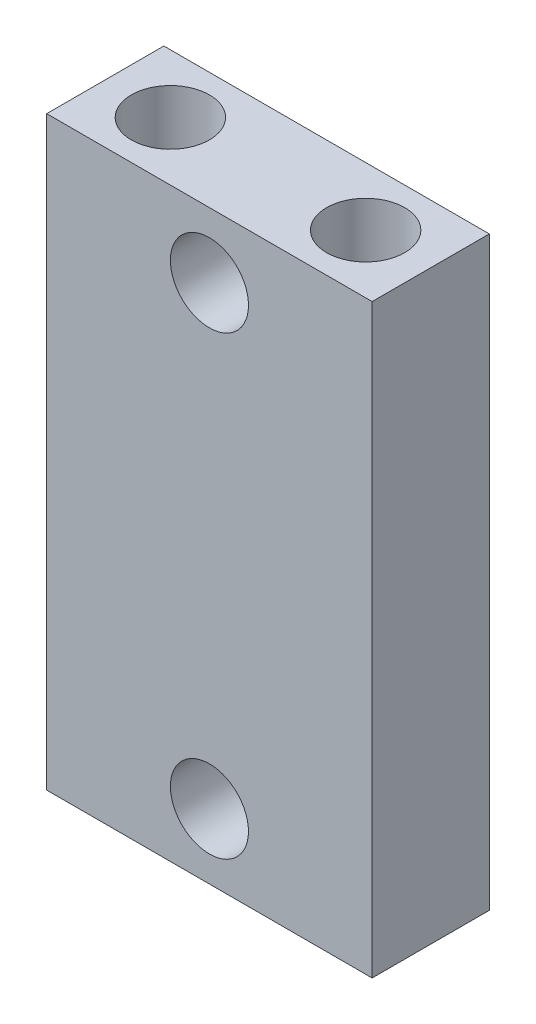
from build123d import *

# Parameters (mm, degrees)
SKETCH1_W           = 12.7
SKETCH1_H           = 4.572
BOSS_EXTRUDE1_DEPTH = 22.86
SKETCH2_R           = 1.524
CUT_EXTRUDE1_DEPTH  = 7.62
SKETCH3_R           = 1.524
CUT_EXTRUDE2_DEPTH  = 27.547557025


with BuildPart() as part:
    # Sketch1 → Boss-Extrude1 (new body)
    with BuildSketch(Plane(origin=(0, 0, 0), x_dir=(1, 0, 0), z_dir=(0, 1, 0))):
        with Locations((6.35, 2.286)):
            Rectangle(SKETCH1_W, SKETCH1_H)
    extrude(amount=BOSS_EXTRUDE1_DEPTH)

    # Sketch2 → Cut-Extrude1 (cut)
    with BuildSketch(Plane(origin=(0, 22.86, 0), x_dir=(1, 0, 0), z_dir=(0, 1, 0))):
        with Locations(Location((2.54, 2.286, 0), (0, 0, 270))):
            Circle(SKETCH2_R)
        with Locations(Location((10.16, 2.286, 0), (0, 0, 270))):
            Circle(SKETCH2_R)
    extrude(amount=-CUT_EXTRUDE1_DEPTH, mode=Mode.SUBTRACT)

    # Sketch3 → Cut-Extrude2 (cut, through all)
    with BuildSketch(Plane.XY):
        with Locations((6.35, 20.32)):
            Circle(SKETCH3_R)
        with Locations((6.35, 2.54)):
            Circle(SKETCH3_R)
    extrude(amount=-CUT_EXTRUDE2_DEPTH, mode=Mode.SUBTRACT)


solid = part.part
